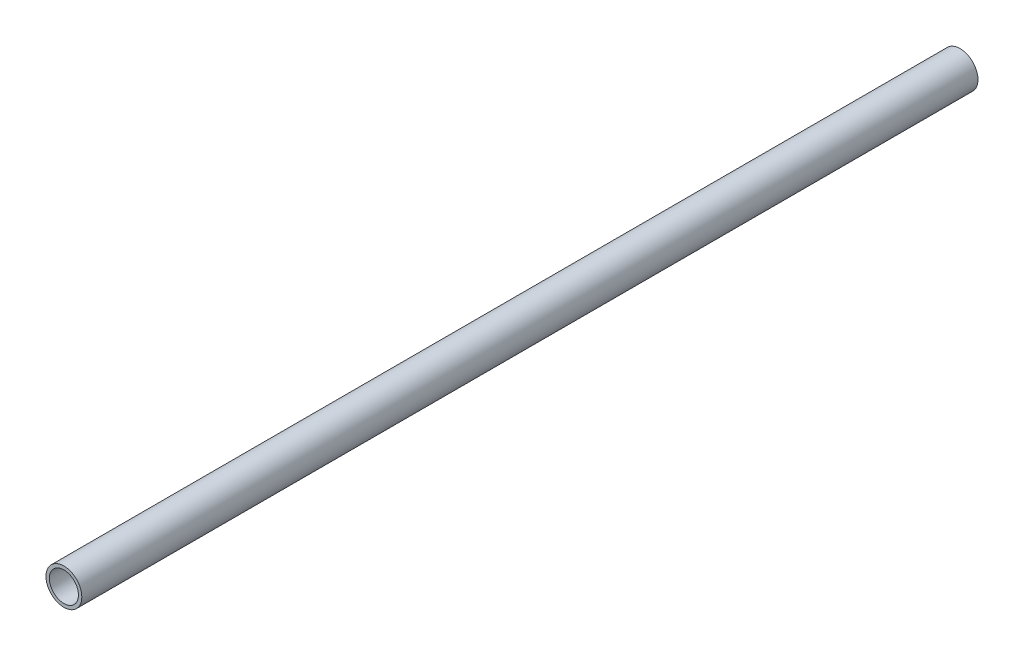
from build123d import *

# Parameters (mm, degrees)
CROQUIS1_R              = 8
CROQUIS1_R_2            = 6.5
SALIENTE_EXTRUIR1_DEPTH = 400


with BuildPart() as part:
    # Croquis1 → Saliente-Extruir1 (new body)
    with BuildSketch(Plane.XY):
        Circle(CROQUIS1_R)
        Circle(CROQUIS1_R_2, mode=Mode.SUBTRACT)
    extrude(amount=SALIENTE_EXTRUIR1_DEPTH)


solid = part.part
